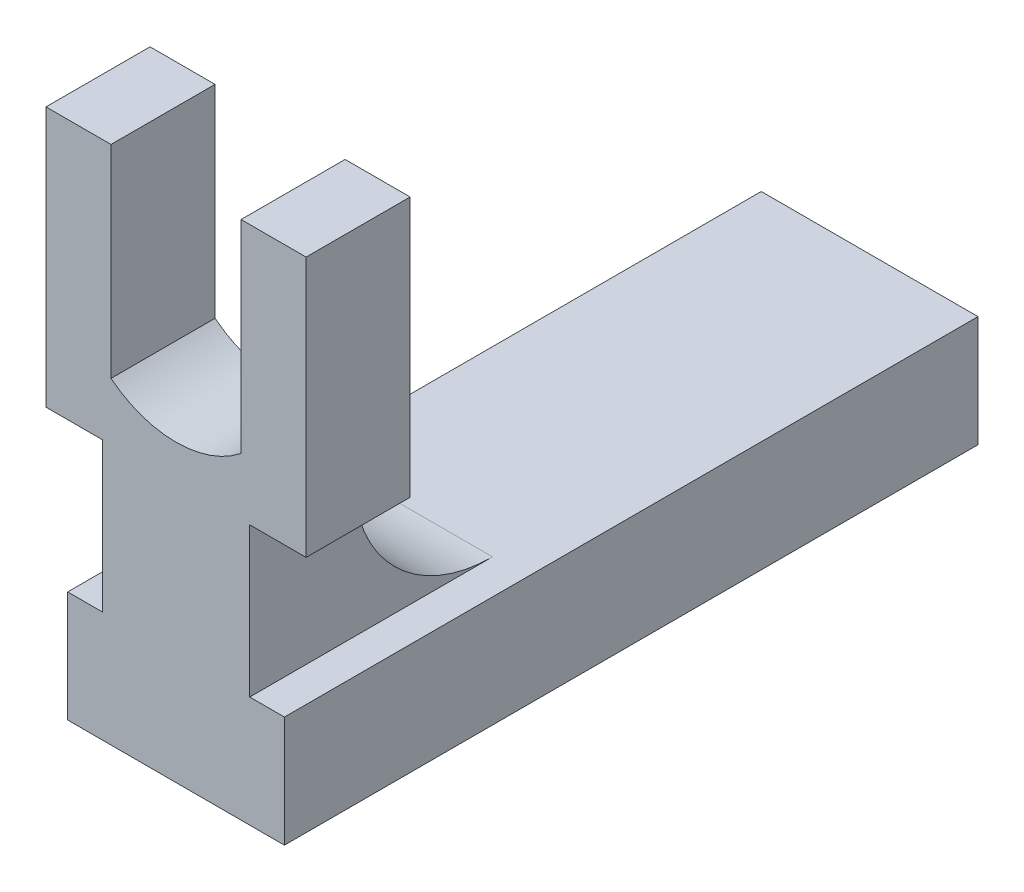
from build123d import *

# Parameters (mm, degrees)
EXTRUDE_1_DEPTH     = 40
SKETCH_2_OUTSIDE_W  = 52.44
SKETCH_2_OUTSIDE_H  = 42.44
CUT_EXTRUDE_1_DEPTH = 40


with BuildPart() as part:
    # Sketch 1 → Extrude 1 (new body)
    with BuildSketch(Plane.XY):
        with BuildLine():
            Line((1.25, 0), (1.25, 6.4))
            Line((1.25, 6.4), (3.25, 6.4))
            Line((3.25, 6.4), (3.25, 15))
            Line((3.25, 15), (0, 15))
            Line((0, 15), (0, 30))
            Line((0, 30), (3.75, 30))
            Line((3.75, 30), (3.75, 18.316251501))
            ThreePointArc((3.75, 18.316251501), (7.5, 17), (11.25, 18.316251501))
            Line((11.25, 18.316251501), (11.25, 30))
            Line((11.25, 30), (15, 30))
            Line((15, 30), (15, 15))
            Line((15, 15), (11.75, 15))
            Line((11.75, 15), (11.75, 6.4))
            Line((11.75, 6.4), (13.75, 6.4))
            Line((13.75, 6.4), (13.75, 0))
            Line((13.75, 0), (1.25, 0))
        make_face()
    extrude(amount=EXTRUDE_1_DEPTH)

    # Sketch 2 outside → Cut-Extrude 1 (cut)
    with BuildSketch(Plane(origin=(15, 0, 0), x_dir=(0, 0, -1), z_dir=(1, 0, 0))):
        with Locations((-20, 15)):
            Rectangle(SKETCH_2_OUTSIDE_W, SKETCH_2_OUTSIDE_H)
        with BuildLine():
            Line((-40, 0), (-40, 30))
            Line((-40, 30), (-34, 30))
            Line((-34, 30), (-34, 14.4))
            ThreePointArc((-34, 14.4), (-31.656854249, 8.743145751), (-26, 6.4))
            Line((-26, 6.4), (0, 6.4))
            Line((0, 6.4), (0, 0))
            Line((0, 0), (-40, 0))
        make_face(mode=Mode.SUBTRACT)
    extrude(amount=-CUT_EXTRUDE_1_DEPTH, mode=Mode.SUBTRACT)


solid = part.part
